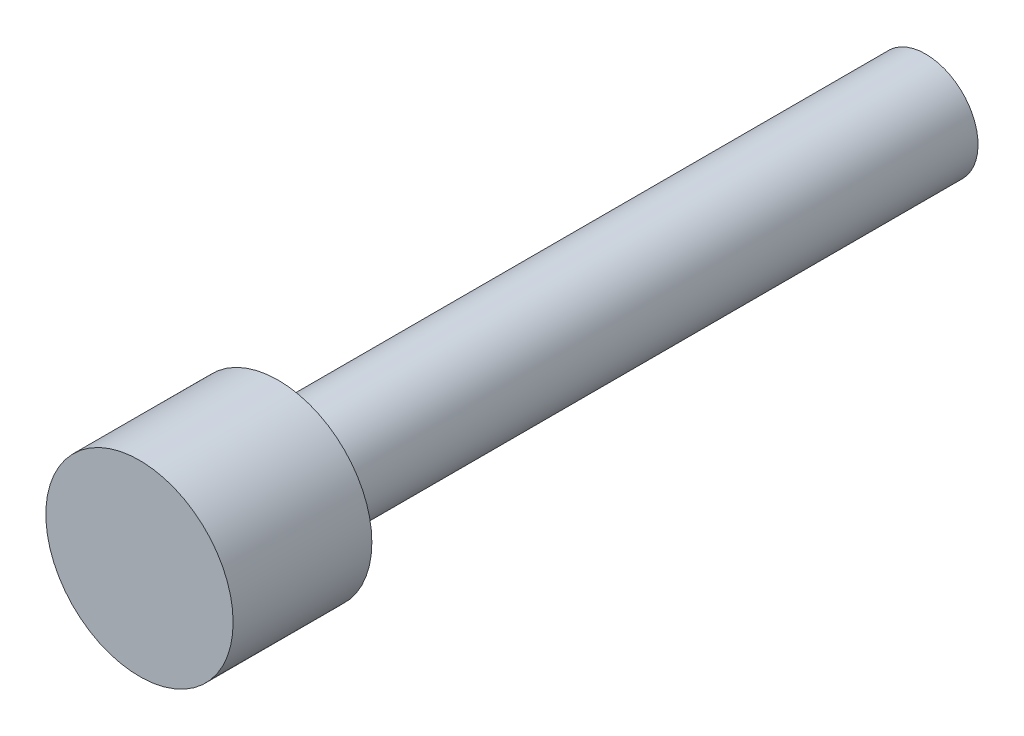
from build123d import *

# Parameters (mm, degrees)
SKETCH1_R           = 6.429375
BOSS_EXTRUDE1_DEPTH = 9.525
SKETCH2_R           = 3.59537
BOSS_EXTRUDE2_DEPTH = 44.45


with BuildPart() as part:
    # Sketch1 → Boss-Extrude1 (new body)
    with BuildSketch(Plane.XY):
        Circle(SKETCH1_R)
    extrude(amount=-BOSS_EXTRUDE1_DEPTH)

    # Sketch2 → Boss-Extrude2 (add)
    with BuildSketch(Plane(origin=(0, 0, -9.525), x_dir=(-1, 0, 0), z_dir=(0, 0, -1))):
        with Locations(Location((0, 0, 0), (0, 0, 90))):
            Circle(SKETCH2_R)
    extrude(amount=BOSS_EXTRUDE2_DEPTH)


solid = part.part
